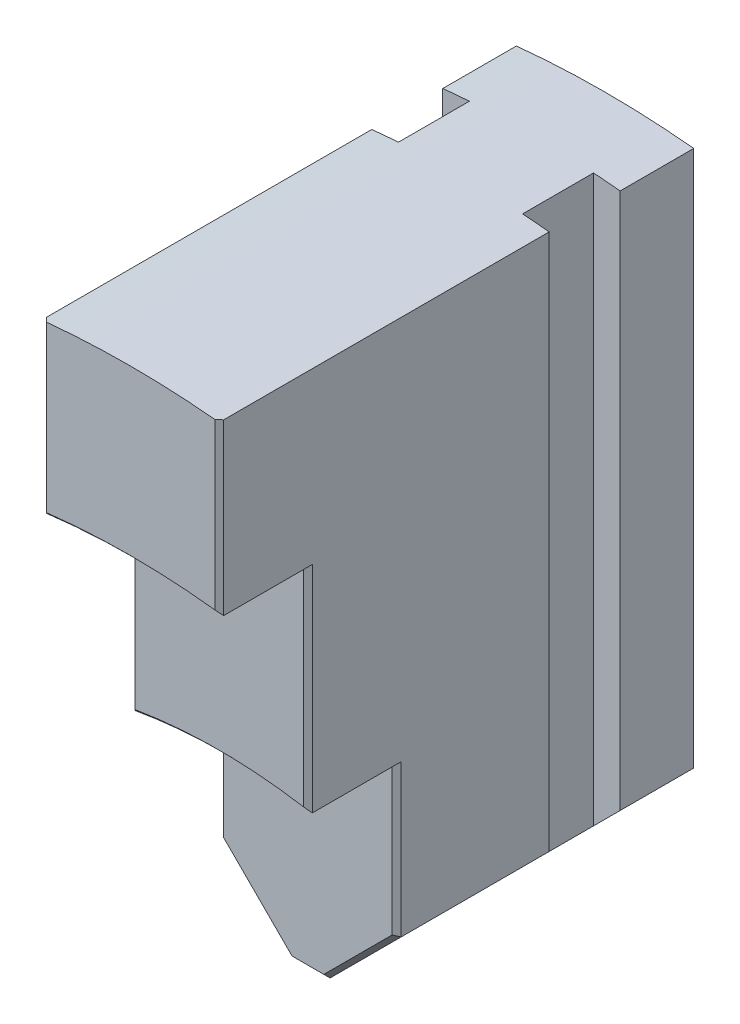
ISO-10303-21;
HEADER;
FILE_DESCRIPTION(('STEP AP214'),'2;1');
FILE_NAME('part.step','',(''),(''),'','','');
FILE_SCHEMA(('AUTOMOTIVE_DESIGN { 1 0 10303 214 1 1 1 1 }'));
ENDSEC;
DATA;
#1=APPLICATION_CONTEXT('core data for automotive mechanical design processes');
#2=APPLICATION_PROTOCOL_DEFINITION('international standard','automotive_design',2000,#1);
#3=PRODUCT_CONTEXT('',#1,'mechanical');
#4=PRODUCT('Part','Part','',(#3));
#5=PRODUCT_RELATED_PRODUCT_CATEGORY('part','',(#4));
#6=PRODUCT_DEFINITION_FORMATION('','',#4);
#7=PRODUCT_DEFINITION_CONTEXT('part definition',#1,'design');
#8=PRODUCT_DEFINITION('design','',#6,#7);
#9=PRODUCT_DEFINITION_SHAPE('','',#8);
#10=(LENGTH_UNIT() NAMED_UNIT(*) SI_UNIT(.MILLI.,.METRE.));
#11=(NAMED_UNIT(*) PLANE_ANGLE_UNIT() SI_UNIT($,.RADIAN.));
#12=(NAMED_UNIT(*) SI_UNIT($,.STERADIAN.) SOLID_ANGLE_UNIT());
#13=UNCERTAINTY_MEASURE_WITH_UNIT(LENGTH_MEASURE(1.E-05),#10,'distance_accuracy_value','');
#14=(GEOMETRIC_REPRESENTATION_CONTEXT(3) GLOBAL_UNCERTAINTY_ASSIGNED_CONTEXT((#13)) GLOBAL_UNIT_ASSIGNED_CONTEXT((#10,
#11,#12)) REPRESENTATION_CONTEXT('',''));
#15=CARTESIAN_POINT('',(0.,0.,0.));
#16=DIRECTION('',(0.,0.,1.));
#17=DIRECTION('',(1.,0.,0.));
#18=AXIS2_PLACEMENT_3D('',#15,#16,#17);
#19=CARTESIAN_POINT('',(2.,0.,32.5));
#20=DIRECTION('',(-0.707106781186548,0.707106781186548,0.));
#21=DIRECTION('',(-0.707106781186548,-0.707106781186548,0.));
#22=AXIS2_PLACEMENT_3D('',#19,#20,#21);
#23=PLANE('',#22);
#24=DIRECTION('',(0.,0.,-1.));
#25=VECTOR('',#24,1.);
#26=CARTESIAN_POINT('',(10.,8.,32.5));
#27=LINE('',#26,#25);
#28=CARTESIAN_POINT('',(10.,8.,12.));
#29=VERTEX_POINT('',#28);
#30=CARTESIAN_POINT('',(10.,8.,-4.7));
#31=VERTEX_POINT('',#30);
#32=EDGE_CURVE('E269',#29,#31,#27,.T.);
#33=ORIENTED_EDGE('',*,*,#32,.F.);
#34=DIRECTION('',(-0.707106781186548,-0.707106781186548,0.));
#35=VECTOR('',#34,1.);
#36=CARTESIAN_POINT('',(2.,0.,12.));
#37=LINE('',#36,#35);
#38=CARTESIAN_POINT('',(2.,0.,12.));
#39=VERTEX_POINT('',#38);
#40=EDGE_CURVE('E311',#29,#39,#37,.T.);
#41=ORIENTED_EDGE('',*,*,#40,.T.);
#42=DIRECTION('',(0.,0.,-1.));
#43=VECTOR('',#42,1.);
#44=CARTESIAN_POINT('',(2.,0.,32.5));
#45=LINE('',#44,#43);
#46=CARTESIAN_POINT('',(2.,0.,-21.));
#47=VERTEX_POINT('',#46);
#48=EDGE_CURVE('E271',#39,#47,#45,.T.);
#49=ORIENTED_EDGE('',*,*,#48,.T.);
#50=DIRECTION('',(0.707106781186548,0.707106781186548,0.));
#51=VECTOR('',#50,1.);
#52=CARTESIAN_POINT('',(2.,0.,-21.));
#53=LINE('',#52,#51);
#54=CARTESIAN_POINT('',(10.,8.,-21.));
#55=VERTEX_POINT('',#54);
#56=EDGE_CURVE('E258',#47,#55,#53,.T.);
#57=ORIENTED_EDGE('',*,*,#56,.T.);
#58=CARTESIAN_POINT('',(10.,8.,-12.7));
#59=VERTEX_POINT('',#58);
#60=EDGE_CURVE('E268',#59,#55,#27,.T.);
#61=ORIENTED_EDGE('',*,*,#60,.F.);
#62=DIRECTION('',(0.707106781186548,0.707106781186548,0.));
#63=VECTOR('',#62,1.);
#64=CARTESIAN_POINT('',(2.,0.,-12.7));
#65=LINE('',#64,#63);
#66=CARTESIAN_POINT('',(7.,5.,-12.7));
#67=VERTEX_POINT('',#66);
#68=EDGE_CURVE('E223',#67,#59,#65,.T.);
#69=ORIENTED_EDGE('',*,*,#68,.F.);
#70=DIRECTION('',(0.,0.,-1.));
#71=VECTOR('',#70,1.);
#72=CARTESIAN_POINT('',(7.,5.,32.5));
#73=LINE('',#72,#71);
#74=CARTESIAN_POINT('',(7.00000000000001,5.00000000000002,-4.7));
#75=VERTEX_POINT('',#74);
#76=EDGE_CURVE('E292',#75,#67,#73,.T.);
#77=ORIENTED_EDGE('',*,*,#76,.F.);
#78=DIRECTION('',(-0.707106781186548,-0.707106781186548,0.));
#79=VECTOR('',#78,1.);
#80=CARTESIAN_POINT('',(2.,0.,-4.7));
#81=LINE('',#80,#79);
#82=EDGE_CURVE('E217',#31,#75,#81,.T.);
#83=ORIENTED_EDGE('',*,*,#82,.F.);
#84=EDGE_LOOP('',(#33,#41,#49,#57,#61,#69,#77,#83));
#85=FACE_BOUND('',#84,.T.);
#86=ADVANCED_FACE('F29',(#85),#23,.F.);
#87=CARTESIAN_POINT('',(-2.,0.,32.5));
#88=DIRECTION('',(0.707106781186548,0.707106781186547,0.));
#89=DIRECTION('',(-0.707106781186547,0.707106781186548,0.));
#90=AXIS2_PLACEMENT_3D('',#87,#88,#89);
#91=PLANE('',#90);
#92=DIRECTION('',(0.,0.,-1.));
#93=VECTOR('',#92,1.);
#94=CARTESIAN_POINT('',(-2.,0.,32.5));
#95=LINE('',#94,#93);
#96=CARTESIAN_POINT('',(-2.,0.,12.));
#97=VERTEX_POINT('',#96);
#98=CARTESIAN_POINT('',(-2.,0.,-21.));
#99=VERTEX_POINT('',#98);
#100=EDGE_CURVE('E273',#97,#99,#95,.T.);
#101=ORIENTED_EDGE('',*,*,#100,.F.);
#102=DIRECTION('',(-0.707106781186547,0.707106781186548,0.));
#103=VECTOR('',#102,1.);
#104=CARTESIAN_POINT('',(-10.,8.,12.));
#105=LINE('',#104,#103);
#106=CARTESIAN_POINT('',(-10.,8.,12.));
#107=VERTEX_POINT('',#106);
#108=EDGE_CURVE('E315',#97,#107,#105,.T.);
#109=ORIENTED_EDGE('',*,*,#108,.T.);
#110=DIRECTION('',(0.,0.,-1.));
#111=VECTOR('',#110,1.);
#112=CARTESIAN_POINT('',(-10.,8.,32.5));
#113=LINE('',#112,#111);
#114=CARTESIAN_POINT('',(-10.,8.,-4.7));
#115=VERTEX_POINT('',#114);
#116=EDGE_CURVE('E276',#107,#115,#113,.T.);
#117=ORIENTED_EDGE('',*,*,#116,.T.);
#118=DIRECTION('',(-0.707106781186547,0.707106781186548,0.));
#119=VECTOR('',#118,1.);
#120=CARTESIAN_POINT('',(-2.,0.,-4.7));
#121=LINE('',#120,#119);
#122=CARTESIAN_POINT('',(-7.,5.,-4.7));
#123=VERTEX_POINT('',#122);
#124=EDGE_CURVE('E285',#123,#115,#121,.T.);
#125=ORIENTED_EDGE('',*,*,#124,.F.);
#126=DIRECTION('',(0.,0.,1.));
#127=VECTOR('',#126,1.);
#128=CARTESIAN_POINT('',(-7.,5.,32.5));
#129=LINE('',#128,#127);
#130=CARTESIAN_POINT('',(-7.,5.,-12.7));
#131=VERTEX_POINT('',#130);
#132=EDGE_CURVE('E283',#131,#123,#129,.T.);
#133=ORIENTED_EDGE('',*,*,#132,.F.);
#134=DIRECTION('',(0.707106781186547,-0.707106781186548,0.));
#135=VECTOR('',#134,1.);
#136=CARTESIAN_POINT('',(-2.,0.,-12.7));
#137=LINE('',#136,#135);
#138=CARTESIAN_POINT('',(-10.,8.,-12.7));
#139=VERTEX_POINT('',#138);
#140=EDGE_CURVE('E281',#139,#131,#137,.T.);
#141=ORIENTED_EDGE('',*,*,#140,.F.);
#142=CARTESIAN_POINT('',(-10.,8.,-21.));
#143=VERTEX_POINT('',#142);
#144=EDGE_CURVE('E275',#139,#143,#113,.T.);
#145=ORIENTED_EDGE('',*,*,#144,.T.);
#146=DIRECTION('',(0.707106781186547,-0.707106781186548,0.));
#147=VECTOR('',#146,1.);
#148=CARTESIAN_POINT('',(-2.,0.,-21.));
#149=LINE('',#148,#147);
#150=EDGE_CURVE('E252',#143,#99,#149,.T.);
#151=ORIENTED_EDGE('',*,*,#150,.T.);
#152=EDGE_LOOP('',(#101,#109,#117,#125,#133,#141,#145,#151));
#153=FACE_BOUND('',#152,.T.);
#154=ADVANCED_FACE('F420',(#153),#91,.F.);
#155=CARTESIAN_POINT('',(-2.,0.,32.5));
#156=DIRECTION('',(0.,1.,0.));
#157=DIRECTION('',(0.,0.,1.));
#158=AXIS2_PLACEMENT_3D('',#155,#156,#157);
#159=PLANE('',#158);
#160=ORIENTED_EDGE('',*,*,#48,.F.);
#161=DIRECTION('',(-1.,0.,0.));
#162=VECTOR('',#161,1.);
#163=CARTESIAN_POINT('',(-2.,0.,12.));
#164=LINE('',#163,#162);
#165=EDGE_CURVE('E313',#39,#97,#164,.T.);
#166=ORIENTED_EDGE('',*,*,#165,.T.);
#167=ORIENTED_EDGE('',*,*,#100,.T.);
#168=DIRECTION('',(1.,0.,0.));
#169=VECTOR('',#168,1.);
#170=CARTESIAN_POINT('',(-2.,0.,-21.));
#171=LINE('',#170,#169);
#172=EDGE_CURVE('E255',#99,#47,#171,.T.);
#173=ORIENTED_EDGE('',*,*,#172,.T.);
#174=EDGE_LOOP('',(#160,#166,#167,#173));
#175=FACE_BOUND('',#174,.T.);
#176=ADVANCED_FACE('F426',(#175),#159,.F.);
#177=CARTESIAN_POINT('',(0.,-31.,32.5));
#178=DIRECTION('',(0.,0.,-1.));
#179=DIRECTION('',(-1.,0.,0.));
#180=AXIS2_PLACEMENT_3D('',#177,#178,#179);
#181=CYLINDRICAL_SURFACE('',#180,100.);
#182=CARTESIAN_POINT('',(0.,-31.,32.5));
#183=DIRECTION('',(0.,0.,1.));
#184=DIRECTION('',(1.,0.,0.));
#185=AXIS2_PLACEMENT_3D('',#182,#183,#184);
#186=CIRCLE('',#185,100.);
#187=CARTESIAN_POINT('',(9.5,68.5477272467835,32.5));
#188=VERTEX_POINT('',#187);
#189=CARTESIAN_POINT('',(-9.5,68.5477272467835,32.5));
#190=VERTEX_POINT('',#189);
#191=EDGE_CURVE('E264',#188,#190,#186,.T.);
#192=ORIENTED_EDGE('',*,*,#191,.F.);
#193=CARTESIAN_POINT('',(0.,-31.,42.));
#194=DIRECTION('',(0.707106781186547,0.,0.707106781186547));
#195=DIRECTION('',(0.707106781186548,0.,-0.707106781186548));
#196=AXIS2_PLACEMENT_3D('',#193,#194,#195);
#197=ELLIPSE('',#196,141.42135623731,100.);
#198=CARTESIAN_POINT('',(10.,68.498743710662,32.));
#199=VERTEX_POINT('',#198);
#200=EDGE_CURVE('E340',#188,#199,#197,.F.);
#201=ORIENTED_EDGE('',*,*,#200,.T.);
#202=DIRECTION('',(0.,0.,-1.));
#203=VECTOR('',#202,1.);
#204=CARTESIAN_POINT('',(10.,68.498743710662,32.5));
#205=LINE('',#204,#203);
#206=CARTESIAN_POINT('',(10.,68.498743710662,-4.7));
#207=VERTEX_POINT('',#206);
#208=EDGE_CURVE('E222',#199,#207,#205,.T.);
#209=ORIENTED_EDGE('',*,*,#208,.T.);
#210=CARTESIAN_POINT('',(0.,-31.,-4.7));
#211=DIRECTION('',(0.,0.,-1.));
#212=DIRECTION('',(-1.,0.,0.));
#213=AXIS2_PLACEMENT_3D('',#210,#211,#212);
#214=CIRCLE('',#213,100.);
#215=CARTESIAN_POINT('',(7.,68.7546991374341,-4.7));
#216=VERTEX_POINT('',#215);
#217=EDGE_CURVE('E214',#216,#207,#214,.T.);
#218=ORIENTED_EDGE('',*,*,#217,.F.);
#219=DIRECTION('',(0.,0.,-1.));
#220=VECTOR('',#219,1.);
#221=CARTESIAN_POINT('',(7.,68.7546991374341,32.5));
#222=LINE('',#221,#220);
#223=CARTESIAN_POINT('',(7.,68.7546991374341,-12.7));
#224=VERTEX_POINT('',#223);
#225=EDGE_CURVE('E197',#224,#216,#222,.F.);
#226=ORIENTED_EDGE('',*,*,#225,.F.);
#227=CARTESIAN_POINT('',(0.,-31.,-12.7));
#228=DIRECTION('',(0.,0.,1.));
#229=DIRECTION('',(1.,0.,0.));
#230=AXIS2_PLACEMENT_3D('',#227,#228,#229);
#231=CIRCLE('',#230,100.);
#232=CARTESIAN_POINT('',(10.,68.498743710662,-12.7));
#233=VERTEX_POINT('',#232);
#234=EDGE_CURVE('E208',#233,#224,#231,.T.);
#235=ORIENTED_EDGE('',*,*,#234,.F.);
#236=CARTESIAN_POINT('',(10.,68.498743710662,-21.));
#237=VERTEX_POINT('',#236);
#238=EDGE_CURVE('E266',#233,#237,#205,.T.);
#239=ORIENTED_EDGE('',*,*,#238,.T.);
#240=CARTESIAN_POINT('',(0.,-31.,-21.));
#241=DIRECTION('',(0.,0.,1.));
#242=DIRECTION('',(1.,0.,0.));
#243=AXIS2_PLACEMENT_3D('',#240,#241,#242);
#244=CIRCLE('',#243,100.);
#245=CARTESIAN_POINT('',(-10.,68.498743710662,-21.));
#246=VERTEX_POINT('',#245);
#247=EDGE_CURVE('E246',#237,#246,#244,.T.);
#248=ORIENTED_EDGE('',*,*,#247,.T.);
#249=DIRECTION('',(0.,0.,-1.));
#250=VECTOR('',#249,1.);
#251=CARTESIAN_POINT('',(-10.,68.498743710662,32.5));
#252=LINE('',#251,#250);
#253=CARTESIAN_POINT('',(-10.,68.498743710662,-12.7));
#254=VERTEX_POINT('',#253);
#255=EDGE_CURVE('E278',#254,#246,#252,.T.);
#256=ORIENTED_EDGE('',*,*,#255,.F.);
#257=CARTESIAN_POINT('',(0.,-31.,-12.7));
#258=DIRECTION('',(0.,0.,1.));
#259=DIRECTION('',(1.,0.,0.));
#260=AXIS2_PLACEMENT_3D('',#257,#258,#259);
#261=CIRCLE('',#260,100.);
#262=CARTESIAN_POINT('',(-7.,68.7546991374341,-12.7));
#263=VERTEX_POINT('',#262);
#264=EDGE_CURVE('E237',#263,#254,#261,.T.);
#265=ORIENTED_EDGE('',*,*,#264,.F.);
#266=DIRECTION('',(0.,0.,-1.));
#267=VECTOR('',#266,1.);
#268=CARTESIAN_POINT('',(-7.,68.7546991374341,32.5));
#269=LINE('',#268,#267);
#270=CARTESIAN_POINT('',(-7.,68.7546991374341,-4.7));
#271=VERTEX_POINT('',#270);
#272=EDGE_CURVE('E239',#271,#263,#269,.T.);
#273=ORIENTED_EDGE('',*,*,#272,.F.);
#274=CARTESIAN_POINT('',(0.,-31.,-4.7));
#275=DIRECTION('',(0.,0.,-1.));
#276=DIRECTION('',(-1.,0.,0.));
#277=AXIS2_PLACEMENT_3D('',#274,#275,#276);
#278=CIRCLE('',#277,100.);
#279=CARTESIAN_POINT('',(-10.,68.498743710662,-4.7));
#280=VERTEX_POINT('',#279);
#281=EDGE_CURVE('E244',#280,#271,#278,.T.);
#282=ORIENTED_EDGE('',*,*,#281,.F.);
#283=CARTESIAN_POINT('',(-10.,68.498743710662,32.));
#284=VERTEX_POINT('',#283);
#285=EDGE_CURVE('E279',#284,#280,#252,.T.);
#286=ORIENTED_EDGE('',*,*,#285,.F.);
#287=CARTESIAN_POINT('',(0.,-31.,42.));
#288=DIRECTION('',(-0.707106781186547,0.,0.707106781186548));
#289=DIRECTION('',(-0.707106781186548,0.,-0.707106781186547));
#290=AXIS2_PLACEMENT_3D('',#287,#288,#289);
#291=ELLIPSE('',#290,141.421356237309,100.);
#292=EDGE_CURVE('E338',#284,#190,#291,.F.);
#293=ORIENTED_EDGE('',*,*,#292,.T.);
#294=EDGE_LOOP('',(#192,#201,#209,#218,#226,#235,#239,#248,#256,#265,#273,#282,#286,#293));
#295=FACE_BOUND('',#294,.T.);
#296=ADVANCED_FACE('F31',(#295),#181,.T.);
#297=CARTESIAN_POINT('',(10.,8.,32.5));
#298=DIRECTION('',(-1.,0.,0.));
#299=DIRECTION('',(0.,0.,1.));
#300=AXIS2_PLACEMENT_3D('',#297,#298,#299);
#301=PLANE('',#300);
#302=DIRECTION('',(0.,1.,0.));
#303=VECTOR('',#302,1.);
#304=CARTESIAN_POINT('',(10.,8.,-12.7));
#305=LINE('',#304,#303);
#306=EDGE_CURVE('E290',#59,#233,#305,.T.);
#307=ORIENTED_EDGE('',*,*,#306,.F.);
#308=ORIENTED_EDGE('',*,*,#60,.T.);
#309=DIRECTION('',(0.,1.,0.));
#310=VECTOR('',#309,1.);
#311=CARTESIAN_POINT('',(10.,8.,-21.));
#312=LINE('',#311,#310);
#313=EDGE_CURVE('E261',#55,#237,#312,.T.);
#314=ORIENTED_EDGE('',*,*,#313,.T.);
#315=ORIENTED_EDGE('',*,*,#238,.F.);
#316=EDGE_LOOP('',(#307,#308,#314,#315));
#317=FACE_BOUND('',#316,.T.);
#318=ADVANCED_FACE('F432',(#317),#301,.F.);
#319=DIRECTION('',(0.,0.,1.));
#320=VECTOR('',#319,1.);
#321=CARTESIAN_POINT('',(10.,25.1159513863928,12.5));
#322=LINE('',#321,#320);
#323=CARTESIAN_POINT('',(10.,25.1159513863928,22.));
#324=VERTEX_POINT('',#323);
#325=CARTESIAN_POINT('',(10.,25.1159513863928,12.));
#326=VERTEX_POINT('',#325);
#327=EDGE_CURVE('E366',#324,#326,#322,.F.);
#328=ORIENTED_EDGE('',*,*,#327,.T.);
#329=DIRECTION('',(0.,-1.,0.));
#330=VECTOR('',#329,1.);
#331=CARTESIAN_POINT('',(10.,8.,12.));
#332=LINE('',#331,#330);
#333=EDGE_CURVE('E309',#326,#29,#332,.T.);
#334=ORIENTED_EDGE('',*,*,#333,.T.);
#335=ORIENTED_EDGE('',*,*,#32,.T.);
#336=DIRECTION('',(0.,-1.,0.));
#337=VECTOR('',#336,1.);
#338=CARTESIAN_POINT('',(10.,8.,-4.7));
#339=LINE('',#338,#337);
#340=EDGE_CURVE('E288',#207,#31,#339,.T.);
#341=ORIENTED_EDGE('',*,*,#340,.F.);
#342=ORIENTED_EDGE('',*,*,#208,.F.);
#343=DIRECTION('',(0.,-1.,0.));
#344=VECTOR('',#343,1.);
#345=CARTESIAN_POINT('',(10.,49.3803458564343,32.));
#346=LINE('',#345,#344);
#347=CARTESIAN_POINT('',(10.,49.3803458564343,32.));
#348=VERTEX_POINT('',#347);
#349=EDGE_CURVE('E305',#199,#348,#346,.T.);
#350=ORIENTED_EDGE('',*,*,#349,.T.);
#351=DIRECTION('',(0.,0.,1.));
#352=VECTOR('',#351,1.);
#353=CARTESIAN_POINT('',(10.,49.3803458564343,22.5));
#354=LINE('',#353,#352);
#355=CARTESIAN_POINT('',(10.,49.3803458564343,22.));
#356=VERTEX_POINT('',#355);
#357=EDGE_CURVE('E218',#348,#356,#354,.F.);
#358=ORIENTED_EDGE('',*,*,#357,.T.);
#359=DIRECTION('',(0.,-1.,0.));
#360=VECTOR('',#359,1.);
#361=CARTESIAN_POINT('',(10.,25.1159513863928,22.));
#362=LINE('',#361,#360);
#363=EDGE_CURVE('E307',#356,#324,#362,.T.);
#364=ORIENTED_EDGE('',*,*,#363,.T.);
#365=EDGE_LOOP('',(#328,#334,#335,#341,#342,#350,#358,#364));
#366=FACE_BOUND('',#365,.T.);
#367=ADVANCED_FACE('F365',(#366),#301,.F.);
#368=CARTESIAN_POINT('',(-10.,8.,32.5));
#369=DIRECTION('',(1.,0.,0.));
#370=DIRECTION('',(0.,1.,0.));
#371=AXIS2_PLACEMENT_3D('',#368,#369,#370);
#372=PLANE('',#371);
#373=ORIENTED_EDGE('',*,*,#116,.F.);
#374=DIRECTION('',(0.,1.,0.));
#375=VECTOR('',#374,1.);
#376=CARTESIAN_POINT('',(-10.,25.1159513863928,12.));
#377=LINE('',#376,#375);
#378=CARTESIAN_POINT('',(-10.,25.1159513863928,12.));
#379=VERTEX_POINT('',#378);
#380=EDGE_CURVE('E322',#107,#379,#377,.T.);
#381=ORIENTED_EDGE('',*,*,#380,.T.);
#382=DIRECTION('',(0.,0.,1.));
#383=VECTOR('',#382,1.);
#384=CARTESIAN_POINT('',(-10.,25.1159513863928,12.5));
#385=LINE('',#384,#383);
#386=CARTESIAN_POINT('',(-10.,25.1159513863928,22.));
#387=VERTEX_POINT('',#386);
#388=EDGE_CURVE('E373',#379,#387,#385,.T.);
#389=ORIENTED_EDGE('',*,*,#388,.T.);
#390=DIRECTION('',(0.,1.,0.));
#391=VECTOR('',#390,1.);
#392=CARTESIAN_POINT('',(-10.,49.3803458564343,22.));
#393=LINE('',#392,#391);
#394=CARTESIAN_POINT('',(-10.,49.3803458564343,22.));
#395=VERTEX_POINT('',#394);
#396=EDGE_CURVE('E319',#387,#395,#393,.T.);
#397=ORIENTED_EDGE('',*,*,#396,.T.);
#398=DIRECTION('',(0.,0.,1.));
#399=VECTOR('',#398,1.);
#400=CARTESIAN_POINT('',(-10.,49.3803458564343,22.5));
#401=LINE('',#400,#399);
#402=CARTESIAN_POINT('',(-10.,49.3803458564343,32.));
#403=VERTEX_POINT('',#402);
#404=EDGE_CURVE('E472',#395,#403,#401,.T.);
#405=ORIENTED_EDGE('',*,*,#404,.T.);
#406=DIRECTION('',(0.,1.,0.));
#407=VECTOR('',#406,1.);
#408=CARTESIAN_POINT('',(-10.,68.498743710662,32.));
#409=LINE('',#408,#407);
#410=EDGE_CURVE('E317',#403,#284,#409,.T.);
#411=ORIENTED_EDGE('',*,*,#410,.T.);
#412=ORIENTED_EDGE('',*,*,#285,.T.);
#413=DIRECTION('',(0.,1.,0.));
#414=VECTOR('',#413,1.);
#415=CARTESIAN_POINT('',(-10.,8.,-4.7));
#416=LINE('',#415,#414);
#417=EDGE_CURVE('E241',#115,#280,#416,.T.);
#418=ORIENTED_EDGE('',*,*,#417,.F.);
#419=EDGE_LOOP('',(#373,#381,#389,#397,#405,#411,#412,#418));
#420=FACE_BOUND('',#419,.T.);
#421=ADVANCED_FACE('F436',(#420),#372,.F.);
#422=DIRECTION('',(0.,-1.,0.));
#423=VECTOR('',#422,1.);
#424=CARTESIAN_POINT('',(-10.,8.,-12.7));
#425=LINE('',#424,#423);
#426=EDGE_CURVE('E235',#254,#139,#425,.T.);
#427=ORIENTED_EDGE('',*,*,#426,.F.);
#428=ORIENTED_EDGE('',*,*,#255,.T.);
#429=DIRECTION('',(0.,-1.,0.));
#430=VECTOR('',#429,1.);
#431=CARTESIAN_POINT('',(-10.,8.,-21.));
#432=LINE('',#431,#430);
#433=EDGE_CURVE('E249',#246,#143,#432,.T.);
#434=ORIENTED_EDGE('',*,*,#433,.T.);
#435=ORIENTED_EDGE('',*,*,#144,.F.);
#436=EDGE_LOOP('',(#427,#428,#434,#435));
#437=FACE_BOUND('',#436,.T.);
#438=ADVANCED_FACE('F438',(#437),#372,.F.);
#439=CARTESIAN_POINT('',(0.,-31.,32.5));
#440=DIRECTION('',(0.,0.,1.));
#441=DIRECTION('',(1.,0.,0.));
#442=AXIS2_PLACEMENT_3D('',#439,#440,#441);
#443=PLANE('',#442);
#444=CARTESIAN_POINT('',(0.,-31.,32.5));
#445=DIRECTION('',(0.,0.,1.));
#446=DIRECTION('',(1.,0.,0.));
#447=AXIS2_PLACEMENT_3D('',#444,#445,#446);
#448=CIRCLE('',#447,81.5);
#449=CARTESIAN_POINT('',(-9.5,49.9444253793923,32.5));
#450=VERTEX_POINT('',#449);
#451=CARTESIAN_POINT('',(9.5,49.9444253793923,32.5));
#452=VERTEX_POINT('',#451);
#453=EDGE_CURVE('E44',#450,#452,#448,.F.);
#454=ORIENTED_EDGE('',*,*,#453,.T.);
#455=DIRECTION('',(0.,1.,0.));
#456=VECTOR('',#455,1.);
#457=CARTESIAN_POINT('',(9.5,68.498743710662,32.5));
#458=LINE('',#457,#456);
#459=EDGE_CURVE('E336',#452,#188,#458,.T.);
#460=ORIENTED_EDGE('',*,*,#459,.T.);
#461=ORIENTED_EDGE('',*,*,#191,.T.);
#462=DIRECTION('',(0.,-1.,0.));
#463=VECTOR('',#462,1.);
#464=CARTESIAN_POINT('',(-9.5,49.3803458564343,32.5));
#465=LINE('',#464,#463);
#466=EDGE_CURVE('E49',#190,#450,#465,.T.);
#467=ORIENTED_EDGE('',*,*,#466,.T.);
#468=EDGE_LOOP('',(#454,#460,#461,#467));
#469=FACE_BOUND('',#468,.T.);
#470=ADVANCED_FACE('F444',(#469),#443,.T.);
#471=CARTESIAN_POINT('',(0.,-31.,-21.));
#472=DIRECTION('',(0.,0.,1.));
#473=DIRECTION('',(1.,0.,0.));
#474=AXIS2_PLACEMENT_3D('',#471,#472,#473);
#475=PLANE('',#474);
#476=ORIENTED_EDGE('',*,*,#247,.F.);
#477=ORIENTED_EDGE('',*,*,#313,.F.);
#478=ORIENTED_EDGE('',*,*,#56,.F.);
#479=ORIENTED_EDGE('',*,*,#172,.F.);
#480=ORIENTED_EDGE('',*,*,#150,.F.);
#481=ORIENTED_EDGE('',*,*,#433,.F.);
#482=EDGE_LOOP('',(#476,#477,#478,#479,#480,#481));
#483=FACE_BOUND('',#482,.T.);
#484=ADVANCED_FACE('F488',(#483),#475,.F.);
#485=CARTESIAN_POINT('',(-17.,69.,-4.7));
#486=DIRECTION('',(0.,0.,-1.));
#487=DIRECTION('',(-1.,0.,0.));
#488=AXIS2_PLACEMENT_3D('',#485,#486,#487);
#489=PLANE('',#488);
#490=ORIENTED_EDGE('',*,*,#281,.T.);
#491=DIRECTION('',(0.,-1.,0.));
#492=VECTOR('',#491,1.);
#493=CARTESIAN_POINT('',(-7.,69.,-4.7));
#494=LINE('',#493,#492);
#495=EDGE_CURVE('E232',#271,#123,#494,.T.);
#496=ORIENTED_EDGE('',*,*,#495,.T.);
#497=ORIENTED_EDGE('',*,*,#124,.T.);
#498=ORIENTED_EDGE('',*,*,#417,.T.);
#499=EDGE_LOOP('',(#490,#496,#497,#498));
#500=FACE_BOUND('',#499,.T.);
#501=ADVANCED_FACE('F506',(#500),#489,.T.);
#502=CARTESIAN_POINT('',(-7.,69.,-12.7));
#503=DIRECTION('',(-1.,0.,0.));
#504=DIRECTION('',(0.,0.,1.));
#505=AXIS2_PLACEMENT_3D('',#502,#503,#504);
#506=PLANE('',#505);
#507=ORIENTED_EDGE('',*,*,#272,.T.);
#508=DIRECTION('',(0.,-1.,0.));
#509=VECTOR('',#508,1.);
#510=CARTESIAN_POINT('',(-7.,69.,-12.7));
#511=LINE('',#510,#509);
#512=EDGE_CURVE('E207',#263,#131,#511,.T.);
#513=ORIENTED_EDGE('',*,*,#512,.T.);
#514=ORIENTED_EDGE('',*,*,#132,.T.);
#515=ORIENTED_EDGE('',*,*,#495,.F.);
#516=EDGE_LOOP('',(#507,#513,#514,#515));
#517=FACE_BOUND('',#516,.T.);
#518=ADVANCED_FACE('F502',(#517),#506,.T.);
#519=CARTESIAN_POINT('',(-17.,69.,-12.7));
#520=DIRECTION('',(0.,0.,1.));
#521=DIRECTION('',(1.,0.,0.));
#522=AXIS2_PLACEMENT_3D('',#519,#520,#521);
#523=PLANE('',#522);
#524=ORIENTED_EDGE('',*,*,#264,.T.);
#525=ORIENTED_EDGE('',*,*,#426,.T.);
#526=ORIENTED_EDGE('',*,*,#140,.T.);
#527=ORIENTED_EDGE('',*,*,#512,.F.);
#528=EDGE_LOOP('',(#524,#525,#526,#527));
#529=FACE_BOUND('',#528,.T.);
#530=ADVANCED_FACE('F498',(#529),#523,.T.);
#531=CARTESIAN_POINT('',(7.,69.,-12.7));
#532=DIRECTION('',(1.,0.,0.));
#533=DIRECTION('',(0.,0.,-1.));
#534=AXIS2_PLACEMENT_3D('',#531,#532,#533);
#535=PLANE('',#534);
#536=ORIENTED_EDGE('',*,*,#225,.T.);
#537=DIRECTION('',(0.,-1.,0.));
#538=VECTOR('',#537,1.);
#539=CARTESIAN_POINT('',(7.,69.,-4.7));
#540=LINE('',#539,#538);
#541=EDGE_CURVE('E200',#216,#75,#540,.T.);
#542=ORIENTED_EDGE('',*,*,#541,.T.);
#543=ORIENTED_EDGE('',*,*,#76,.T.);
#544=DIRECTION('',(0.,-1.,0.));
#545=VECTOR('',#544,1.);
#546=CARTESIAN_POINT('',(7.,69.,-12.7));
#547=LINE('',#546,#545);
#548=EDGE_CURVE('E203',#224,#67,#547,.T.);
#549=ORIENTED_EDGE('',*,*,#548,.F.);
#550=EDGE_LOOP('',(#536,#542,#543,#549));
#551=FACE_BOUND('',#550,.T.);
#552=ADVANCED_FACE('F199',(#551),#535,.T.);
#553=CARTESIAN_POINT('',(17.,69.,-12.7));
#554=DIRECTION('',(0.,0.,1.));
#555=DIRECTION('',(1.,0.,0.));
#556=AXIS2_PLACEMENT_3D('',#553,#554,#555);
#557=PLANE('',#556);
#558=ORIENTED_EDGE('',*,*,#234,.T.);
#559=ORIENTED_EDGE('',*,*,#548,.T.);
#560=ORIENTED_EDGE('',*,*,#68,.T.);
#561=ORIENTED_EDGE('',*,*,#306,.T.);
#562=EDGE_LOOP('',(#558,#559,#560,#561));
#563=FACE_BOUND('',#562,.T.);
#564=ADVANCED_FACE('F477',(#563),#557,.T.);
#565=CARTESIAN_POINT('',(17.,69.,-4.7));
#566=DIRECTION('',(0.,0.,-1.));
#567=DIRECTION('',(-1.,0.,0.));
#568=AXIS2_PLACEMENT_3D('',#565,#566,#567);
#569=PLANE('',#568);
#570=ORIENTED_EDGE('',*,*,#217,.T.);
#571=ORIENTED_EDGE('',*,*,#340,.T.);
#572=ORIENTED_EDGE('',*,*,#82,.T.);
#573=ORIENTED_EDGE('',*,*,#541,.F.);
#574=EDGE_LOOP('',(#570,#571,#572,#573));
#575=FACE_BOUND('',#574,.T.);
#576=ADVANCED_FACE('F212',(#575),#569,.T.);
#577=CARTESIAN_POINT('',(0.,-31.,22.5));
#578=DIRECTION('',(0.,0.,1.));
#579=DIRECTION('',(1.,0.,0.));
#580=AXIS2_PLACEMENT_3D('',#577,#578,#579);
#581=PLANE('',#580);
#582=CARTESIAN_POINT('',(0.,-31.,22.5));
#583=DIRECTION('',(0.,0.,1.));
#584=DIRECTION('',(1.,0.,0.));
#585=AXIS2_PLACEMENT_3D('',#582,#583,#584);
#586=CIRCLE('',#585,57.5);
#587=CARTESIAN_POINT('',(-9.5,25.7097875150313,22.5));
#588=VERTEX_POINT('',#587);
#589=CARTESIAN_POINT('',(9.5,25.7097875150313,22.5));
#590=VERTEX_POINT('',#589);
#591=EDGE_CURVE('E327',#588,#590,#586,.F.);
#592=ORIENTED_EDGE('',*,*,#591,.T.);
#593=DIRECTION('',(0.,1.,0.));
#594=VECTOR('',#593,1.);
#595=CARTESIAN_POINT('',(9.5,49.3803458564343,22.5));
#596=LINE('',#595,#594);
#597=CARTESIAN_POINT('',(9.5,49.4409721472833,22.5));
#598=VERTEX_POINT('',#597);
#599=EDGE_CURVE('E329',#590,#598,#596,.T.);
#600=ORIENTED_EDGE('',*,*,#599,.T.);
#601=CARTESIAN_POINT('',(0.,-31.,22.5));
#602=DIRECTION('',(0.,0.,1.));
#603=DIRECTION('',(1.,0.,0.));
#604=AXIS2_PLACEMENT_3D('',#601,#602,#603);
#605=CIRCLE('',#604,81.);
#606=CARTESIAN_POINT('',(-9.5,49.4409721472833,22.5));
#607=VERTEX_POINT('',#606);
#608=EDGE_CURVE('E356',#598,#607,#605,.T.);
#609=ORIENTED_EDGE('',*,*,#608,.T.);
#610=DIRECTION('',(0.,-1.,0.));
#611=VECTOR('',#610,1.);
#612=CARTESIAN_POINT('',(-9.5,25.1159513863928,22.5));
#613=LINE('',#612,#611);
#614=EDGE_CURVE('E325',#607,#588,#613,.T.);
#615=ORIENTED_EDGE('',*,*,#614,.T.);
#616=EDGE_LOOP('',(#592,#600,#609,#615));
#617=FACE_BOUND('',#616,.T.);
#618=ADVANCED_FACE('F534',(#617),#581,.T.);
#619=CARTESIAN_POINT('',(0.,-31.,22.5));
#620=DIRECTION('',(0.,0.,1.));
#621=DIRECTION('',(1.,0.,0.));
#622=AXIS2_PLACEMENT_3D('',#619,#620,#621);
#623=CYLINDRICAL_SURFACE('',#622,81.);
#624=ORIENTED_EDGE('',*,*,#357,.F.);
#625=CARTESIAN_POINT('',(0.,-31.,32.));
#626=DIRECTION('',(0.,0.,1.));
#627=DIRECTION('',(1.,0.,0.));
#628=AXIS2_PLACEMENT_3D('',#625,#626,#627);
#629=CIRCLE('',#628,81.);
#630=EDGE_CURVE('E342',#348,#403,#629,.T.);
#631=ORIENTED_EDGE('',*,*,#630,.T.);
#632=ORIENTED_EDGE('',*,*,#404,.F.);
#633=CARTESIAN_POINT('',(0.,-31.,32.));
#634=DIRECTION('',(-0.70710678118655,0.,0.707106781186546));
#635=DIRECTION('',(0.707106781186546,0.,0.70710678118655));
#636=AXIS2_PLACEMENT_3D('',#633,#634,#635);
#637=ELLIPSE('',#636,114.551298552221,81.);
#638=EDGE_CURVE('E11',#395,#607,#637,.F.);
#639=ORIENTED_EDGE('',*,*,#638,.T.);
#640=ORIENTED_EDGE('',*,*,#608,.F.);
#641=CARTESIAN_POINT('',(0.,-31.,32.0000000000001));
#642=DIRECTION('',(0.70710678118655,0.,0.707106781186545));
#643=DIRECTION('',(-0.707106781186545,0.,0.70710678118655));
#644=AXIS2_PLACEMENT_3D('',#641,#642,#643);
#645=ELLIPSE('',#644,114.551298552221,81.);
#646=EDGE_CURVE('E37',#598,#356,#645,.F.);
#647=ORIENTED_EDGE('',*,*,#646,.T.);
#648=EDGE_LOOP('',(#624,#631,#632,#639,#640,#647));
#649=FACE_BOUND('',#648,.T.);
#650=ADVANCED_FACE('F353',(#649),#623,.F.);
#651=CARTESIAN_POINT('',(0.,-31.,12.5));
#652=DIRECTION('',(0.,0.,1.));
#653=DIRECTION('',(1.,0.,0.));
#654=AXIS2_PLACEMENT_3D('',#651,#652,#653);
#655=PLANE('',#654);
#656=DIRECTION('',(0.707106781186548,0.707106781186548,0.));
#657=VECTOR('',#656,1.);
#658=CARTESIAN_POINT('',(9.64644660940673,8.35355339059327,12.5));
#659=LINE('',#658,#657);
#660=CARTESIAN_POINT('',(1.79289321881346,0.5,12.5));
#661=VERTEX_POINT('',#660);
#662=CARTESIAN_POINT('',(9.5,8.20710678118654,12.5));
#663=VERTEX_POINT('',#662);
#664=EDGE_CURVE('E300',#661,#663,#659,.T.);
#665=ORIENTED_EDGE('',*,*,#664,.T.);
#666=DIRECTION('',(0.,1.,0.));
#667=VECTOR('',#666,1.);
#668=CARTESIAN_POINT('',(9.5,25.1159513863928,12.5));
#669=LINE('',#668,#667);
#670=CARTESIAN_POINT('',(9.5,25.2027579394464,12.5));
#671=VERTEX_POINT('',#670);
#672=EDGE_CURVE('E302',#663,#671,#669,.T.);
#673=ORIENTED_EDGE('',*,*,#672,.T.);
#674=CARTESIAN_POINT('',(0.,-31.,12.5));
#675=DIRECTION('',(0.,0.,1.));
#676=DIRECTION('',(1.,0.,0.));
#677=AXIS2_PLACEMENT_3D('',#674,#675,#676);
#678=CIRCLE('',#677,57.);
#679=CARTESIAN_POINT('',(-9.5,25.2027579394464,12.5));
#680=VERTEX_POINT('',#679);
#681=EDGE_CURVE('E463',#671,#680,#678,.T.);
#682=ORIENTED_EDGE('',*,*,#681,.T.);
#683=DIRECTION('',(0.,-1.,0.));
#684=VECTOR('',#683,1.);
#685=CARTESIAN_POINT('',(-9.5,8.,12.5));
#686=LINE('',#685,#684);
#687=CARTESIAN_POINT('',(-9.5,8.20710678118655,12.5));
#688=VERTEX_POINT('',#687);
#689=EDGE_CURVE('E294',#680,#688,#686,.T.);
#690=ORIENTED_EDGE('',*,*,#689,.T.);
#691=DIRECTION('',(0.707106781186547,-0.707106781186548,0.));
#692=VECTOR('',#691,1.);
#693=CARTESIAN_POINT('',(-1.64644660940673,0.353553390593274,12.5));
#694=LINE('',#693,#692);
#695=CARTESIAN_POINT('',(-1.79289321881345,0.5,12.5));
#696=VERTEX_POINT('',#695);
#697=EDGE_CURVE('E296',#688,#696,#694,.T.);
#698=ORIENTED_EDGE('',*,*,#697,.T.);
#699=DIRECTION('',(1.,0.,0.));
#700=VECTOR('',#699,1.);
#701=CARTESIAN_POINT('',(2.,0.5,12.5));
#702=LINE('',#701,#700);
#703=EDGE_CURVE('E298',#696,#661,#702,.T.);
#704=ORIENTED_EDGE('',*,*,#703,.T.);
#705=EDGE_LOOP('',(#665,#673,#682,#690,#698,#704));
#706=FACE_BOUND('',#705,.T.);
#707=ADVANCED_FACE('F531',(#706),#655,.T.);
#708=CARTESIAN_POINT('',(0.,-31.,12.5));
#709=DIRECTION('',(0.,0.,1.));
#710=DIRECTION('',(1.,0.,0.));
#711=AXIS2_PLACEMENT_3D('',#708,#709,#710);
#712=CYLINDRICAL_SURFACE('',#711,57.);
#713=ORIENTED_EDGE('',*,*,#327,.F.);
#714=CARTESIAN_POINT('',(0.,-31.,22.));
#715=DIRECTION('',(0.,0.,1.));
#716=DIRECTION('',(1.,0.,0.));
#717=AXIS2_PLACEMENT_3D('',#714,#715,#716);
#718=CIRCLE('',#717,57.);
#719=EDGE_CURVE('E332',#324,#387,#718,.T.);
#720=ORIENTED_EDGE('',*,*,#719,.T.);
#721=ORIENTED_EDGE('',*,*,#388,.F.);
#722=CARTESIAN_POINT('',(0.,-31.,22.));
#723=DIRECTION('',(-0.707106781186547,0.,0.707106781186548));
#724=DIRECTION('',(0.707106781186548,0.,0.707106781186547));
#725=AXIS2_PLACEMENT_3D('',#722,#723,#724);
#726=ELLIPSE('',#725,80.6101730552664,57.);
#727=EDGE_CURVE('E347',#379,#680,#726,.F.);
#728=ORIENTED_EDGE('',*,*,#727,.T.);
#729=ORIENTED_EDGE('',*,*,#681,.F.);
#730=CARTESIAN_POINT('',(0.,-31.,22.));
#731=DIRECTION('',(0.707106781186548,0.,0.707106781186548));
#732=DIRECTION('',(-0.707106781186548,0.,0.707106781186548));
#733=AXIS2_PLACEMENT_3D('',#730,#731,#732);
#734=ELLIPSE('',#733,80.6101730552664,57.);
#735=EDGE_CURVE('E344',#671,#326,#734,.F.);
#736=ORIENTED_EDGE('',*,*,#735,.T.);
#737=EDGE_LOOP('',(#713,#720,#721,#728,#729,#736));
#738=FACE_BOUND('',#737,.T.);
#739=ADVANCED_FACE('F369',(#738),#712,.F.);
#740=CARTESIAN_POINT('',(-9.49999999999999,-31.,12.5));
#741=DIRECTION('',(-0.707106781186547,0.,0.707106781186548));
#742=DIRECTION('',(0.707106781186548,0.,0.707106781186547));
#743=AXIS2_PLACEMENT_3D('',#740,#741,#742);
#744=PLANE('',#743);
#745=ORIENTED_EDGE('',*,*,#727,.F.);
#746=ORIENTED_EDGE('',*,*,#380,.F.);
#747=DIRECTION('',(0.678598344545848,0.281084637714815,0.678598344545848));
#748=VECTOR('',#747,1.);
#749=CARTESIAN_POINT('',(-16.9785035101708,5.10940920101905,5.02149648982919));
#750=LINE('',#749,#748);
#751=EDGE_CURVE('E456',#688,#107,#750,.F.);
#752=ORIENTED_EDGE('',*,*,#751,.F.);
#753=ORIENTED_EDGE('',*,*,#689,.F.);
#754=EDGE_LOOP('',(#745,#746,#752,#753));
#755=FACE_BOUND('',#754,.T.);
#756=ADVANCED_FACE('F454',(#755),#744,.T.);
#757=CARTESIAN_POINT('',(14.8535533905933,-16.1464466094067,12.5));
#758=DIRECTION('',(-0.500000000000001,-0.500000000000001,0.707106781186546));
#759=DIRECTION('',(0.816496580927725,0.,0.577350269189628));
#760=AXIS2_PLACEMENT_3D('',#757,#758,#759);
#761=PLANE('',#760);
#762=ORIENTED_EDGE('',*,*,#751,.T.);
#763=ORIENTED_EDGE('',*,*,#108,.F.);
#764=DIRECTION('',(0.281084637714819,0.678598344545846,0.678598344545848));
#765=VECTOR('',#764,1.);
#766=CARTESIAN_POINT('',(-3.65288386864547,-3.99041465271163,8.00958534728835));
#767=LINE('',#766,#765);
#768=EDGE_CURVE('E464',#696,#97,#767,.F.);
#769=ORIENTED_EDGE('',*,*,#768,.F.);
#770=ORIENTED_EDGE('',*,*,#697,.F.);
#771=EDGE_LOOP('',(#762,#763,#769,#770));
#772=FACE_BOUND('',#771,.T.);
#773=ADVANCED_FACE('F460',(#772),#761,.T.);
#774=CARTESIAN_POINT('',(0.,0.5,12.5));
#775=DIRECTION('',(0.,-0.707106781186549,0.707106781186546));
#776=DIRECTION('',(0.,-0.707106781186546,-0.707106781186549));
#777=AXIS2_PLACEMENT_3D('',#774,#775,#776);
#778=PLANE('',#777);
#779=ORIENTED_EDGE('',*,*,#768,.T.);
#780=ORIENTED_EDGE('',*,*,#165,.F.);
#781=DIRECTION('',(-0.281084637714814,0.678598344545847,0.67859834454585));
#782=VECTOR('',#781,1.);
#783=CARTESIAN_POINT('',(1.65123928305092,0.84198285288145,12.8419828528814));
#784=LINE('',#783,#782);
#785=EDGE_CURVE('E387',#661,#39,#784,.F.);
#786=ORIENTED_EDGE('',*,*,#785,.F.);
#787=ORIENTED_EDGE('',*,*,#703,.F.);
#788=EDGE_LOOP('',(#779,#780,#786,#787));
#789=FACE_BOUND('',#788,.T.);
#790=ADVANCED_FACE('F633',(#789),#778,.T.);
#791=CARTESIAN_POINT('',(-14.8535533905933,-16.1464466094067,12.5));
#792=DIRECTION('',(0.500000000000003,-0.500000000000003,0.707106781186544));
#793=DIRECTION('',(0.816496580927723,0.,-0.57735026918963));
#794=AXIS2_PLACEMENT_3D('',#791,#792,#793);
#795=PLANE('',#794);
#796=ORIENTED_EDGE('',*,*,#785,.T.);
#797=ORIENTED_EDGE('',*,*,#40,.F.);
#798=DIRECTION('',(-0.678598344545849,0.281084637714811,0.678598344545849));
#799=VECTOR('',#798,1.);
#800=CARTESIAN_POINT('',(2.93057677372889,10.9282509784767,19.0694232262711));
#801=LINE('',#800,#799);
#802=EDGE_CURVE('E384',#663,#29,#801,.F.);
#803=ORIENTED_EDGE('',*,*,#802,.F.);
#804=ORIENTED_EDGE('',*,*,#664,.F.);
#805=EDGE_LOOP('',(#796,#797,#803,#804));
#806=FACE_BOUND('',#805,.T.);
#807=ADVANCED_FACE('F524',(#806),#795,.T.);
#808=CARTESIAN_POINT('',(9.5,-31.,12.5));
#809=DIRECTION('',(0.707106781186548,0.,0.707106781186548));
#810=DIRECTION('',(0.707106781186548,0.,-0.707106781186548));
#811=AXIS2_PLACEMENT_3D('',#808,#809,#810);
#812=PLANE('',#811);
#813=ORIENTED_EDGE('',*,*,#802,.T.);
#814=ORIENTED_EDGE('',*,*,#333,.F.);
#815=ORIENTED_EDGE('',*,*,#735,.F.);
#816=ORIENTED_EDGE('',*,*,#672,.F.);
#817=EDGE_LOOP('',(#813,#814,#815,#816));
#818=FACE_BOUND('',#817,.T.);
#819=ADVANCED_FACE('F529',(#818),#812,.T.);
#820=CARTESIAN_POINT('',(-9.5,-31.,22.5));
#821=DIRECTION('',(-0.70710678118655,0.,0.707106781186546));
#822=DIRECTION('',(0.707106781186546,0.,0.70710678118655));
#823=AXIS2_PLACEMENT_3D('',#820,#821,#822);
#824=PLANE('',#823);
#825=ORIENTED_EDGE('',*,*,#638,.F.);
#826=ORIENTED_EDGE('',*,*,#396,.F.);
#827=CARTESIAN_POINT('',(-10.,25.1159513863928,22.));
#828=CARTESIAN_POINT('',(-9.91684806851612,25.2152295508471,22.0831519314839));
#829=CARTESIAN_POINT('',(-9.83360543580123,25.3143549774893,22.1663945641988));
#830=CARTESIAN_POINT('',(-9.6669387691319,25.5123003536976,22.3330612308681));
#831=CARTESIAN_POINT('',(-9.58351473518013,25.6111203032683,22.4164852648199));
#832=CARTESIAN_POINT('',(-9.5,25.7097875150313,22.5));
#833=B_SPLINE_CURVE_WITH_KNOTS('',3,(#827,#828,#829,#830,#831,#832),.UNSPECIFIED.,.F.,.F.,(4,2,
4),(0.,0.461693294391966,0.923386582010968),.UNSPECIFIED.);
#834=EDGE_CURVE('E380',#588,#387,#833,.F.);
#835=ORIENTED_EDGE('',*,*,#834,.F.);
#836=ORIENTED_EDGE('',*,*,#614,.F.);
#837=EDGE_LOOP('',(#825,#826,#835,#836));
#838=FACE_BOUND('',#837,.T.);
#839=ADVANCED_FACE('F402',(#838),#824,.T.);
#840=CARTESIAN_POINT('',(0.,-31.,22.));
#841=DIRECTION('',(0.,0.,1.));
#842=DIRECTION('',(1.,0.,0.));
#843=AXIS2_PLACEMENT_3D('',#840,#841,#842);
#844=CONICAL_SURFACE('',#843,57.,0.785398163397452);
#845=ORIENTED_EDGE('',*,*,#834,.T.);
#846=ORIENTED_EDGE('',*,*,#719,.F.);
#847=CARTESIAN_POINT('',(10.,25.1159513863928,22.));
#848=CARTESIAN_POINT('',(9.91684806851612,25.2152295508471,22.0831519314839));
#849=CARTESIAN_POINT('',(9.83360543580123,25.3143549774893,22.1663945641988));
#850=CARTESIAN_POINT('',(9.6669387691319,25.5123003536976,22.3330612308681));
#851=CARTESIAN_POINT('',(9.58351473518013,25.6111203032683,22.4164852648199));
#852=CARTESIAN_POINT('',(9.5,25.7097875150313,22.5));
#853=B_SPLINE_CURVE_WITH_KNOTS('',3,(#847,#848,#849,#850,#851,#852),.UNSPECIFIED.,.F.,.F.,(4,2,
4),(0.,0.461693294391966,0.923386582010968),.UNSPECIFIED.);
#854=EDGE_CURVE('E362',#590,#324,#853,.F.);
#855=ORIENTED_EDGE('',*,*,#854,.F.);
#856=ORIENTED_EDGE('',*,*,#591,.F.);
#857=EDGE_LOOP('',(#845,#846,#855,#856));
#858=FACE_BOUND('',#857,.T.);
#859=ADVANCED_FACE('F377',(#858),#844,.F.);
#860=CARTESIAN_POINT('',(9.5,-31.,22.5));
#861=DIRECTION('',(0.70710678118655,0.,0.707106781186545));
#862=DIRECTION('',(0.707106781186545,0.,-0.70710678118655));
#863=AXIS2_PLACEMENT_3D('',#860,#861,#862);
#864=PLANE('',#863);
#865=ORIENTED_EDGE('',*,*,#854,.T.);
#866=ORIENTED_EDGE('',*,*,#363,.F.);
#867=ORIENTED_EDGE('',*,*,#646,.F.);
#868=ORIENTED_EDGE('',*,*,#599,.F.);
#869=EDGE_LOOP('',(#865,#866,#867,#868));
#870=FACE_BOUND('',#869,.T.);
#871=ADVANCED_FACE('F360',(#870),#864,.T.);
#872=CARTESIAN_POINT('',(-9.5,-31.,32.5));
#873=DIRECTION('',(-0.707106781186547,0.,0.707106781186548));
#874=DIRECTION('',(0.707106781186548,0.,0.707106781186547));
#875=AXIS2_PLACEMENT_3D('',#872,#873,#874);
#876=PLANE('',#875);
#877=ORIENTED_EDGE('',*,*,#292,.F.);
#878=ORIENTED_EDGE('',*,*,#410,.F.);
#879=CARTESIAN_POINT('',(-10.,49.3803458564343,32.));
#880=CARTESIAN_POINT('',(-9.91677998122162,49.4745599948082,32.0832200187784));
#881=CARTESIAN_POINT('',(-9.83350330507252,49.5686736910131,32.1664966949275));
#882=CARTESIAN_POINT('',(-9.66683663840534,49.7567001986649,32.3331633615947));
#883=CARTESIAN_POINT('',(-9.58344664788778,49.8506130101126,32.4165533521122));
#884=CARTESIAN_POINT('',(-9.5,49.9444253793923,32.5));
#885=B_SPLINE_CURVE_WITH_KNOTS('',3,(#879,#880,#881,#882,#883,#884),.UNSPECIFIED.,.F.,.F.,(4,2,
4),(0.,0.452268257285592,0.90453651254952),.UNSPECIFIED.);
#886=EDGE_CURVE('E389',#450,#403,#885,.F.);
#887=ORIENTED_EDGE('',*,*,#886,.F.);
#888=ORIENTED_EDGE('',*,*,#466,.F.);
#889=EDGE_LOOP('',(#877,#878,#887,#888));
#890=FACE_BOUND('',#889,.T.);
#891=ADVANCED_FACE('F408',(#890),#876,.T.);
#892=CARTESIAN_POINT('',(0.,-31.,32.));
#893=DIRECTION('',(0.,0.,1.));
#894=DIRECTION('',(1.,0.,0.));
#895=AXIS2_PLACEMENT_3D('',#892,#893,#894);
#896=CONICAL_SURFACE('',#895,81.,0.785398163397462);
#897=ORIENTED_EDGE('',*,*,#886,.T.);
#898=ORIENTED_EDGE('',*,*,#630,.F.);
#899=CARTESIAN_POINT('',(10.,49.3803458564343,32.));
#900=CARTESIAN_POINT('',(9.91677998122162,49.4745599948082,32.0832200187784));
#901=CARTESIAN_POINT('',(9.83350330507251,49.5686736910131,32.1664966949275));
#902=CARTESIAN_POINT('',(9.66683663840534,49.7567001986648,32.3331633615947));
#903=CARTESIAN_POINT('',(9.58344664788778,49.8506130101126,32.4165533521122));
#904=CARTESIAN_POINT('',(9.5,49.9444253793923,32.5));
#905=B_SPLINE_CURVE_WITH_KNOTS('',3,(#899,#900,#901,#902,#903,#904),.UNSPECIFIED.,.F.,.F.,(4,2,
4),(0.,0.452268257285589,0.904536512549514),.UNSPECIFIED.);
#906=EDGE_CURVE('E512',#452,#348,#905,.F.);
#907=ORIENTED_EDGE('',*,*,#906,.F.);
#908=ORIENTED_EDGE('',*,*,#453,.F.);
#909=EDGE_LOOP('',(#897,#898,#907,#908));
#910=FACE_BOUND('',#909,.T.);
#911=ADVANCED_FACE('F417',(#910),#896,.F.);
#912=CARTESIAN_POINT('',(9.5,-31.,32.5));
#913=DIRECTION('',(0.707106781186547,0.,0.707106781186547));
#914=DIRECTION('',(0.707106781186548,0.,-0.707106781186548));
#915=AXIS2_PLACEMENT_3D('',#912,#913,#914);
#916=PLANE('',#915);
#917=ORIENTED_EDGE('',*,*,#906,.T.);
#918=ORIENTED_EDGE('',*,*,#349,.F.);
#919=ORIENTED_EDGE('',*,*,#200,.F.);
#920=ORIENTED_EDGE('',*,*,#459,.F.);
#921=EDGE_LOOP('',(#917,#918,#919,#920));
#922=FACE_BOUND('',#921,.T.);
#923=ADVANCED_FACE('F518',(#922),#916,.T.);
#924=CLOSED_SHELL('',(#86,#154,#176,#296,#318,#367,#421,#438,#470,#484,#501,#518,#530,#552,#564,
#576,#618,#650,#707,#739,#756,#773,#790,#807,#819,#839,#859,#871,#891,#911,#923));
#925=MANIFOLD_SOLID_BREP('B2',#924);
#926=ADVANCED_BREP_SHAPE_REPRESENTATION('',(#18,#925),#14);
#927=SHAPE_DEFINITION_REPRESENTATION(#9,#926);
ENDSEC;
END-ISO-10303-21;
